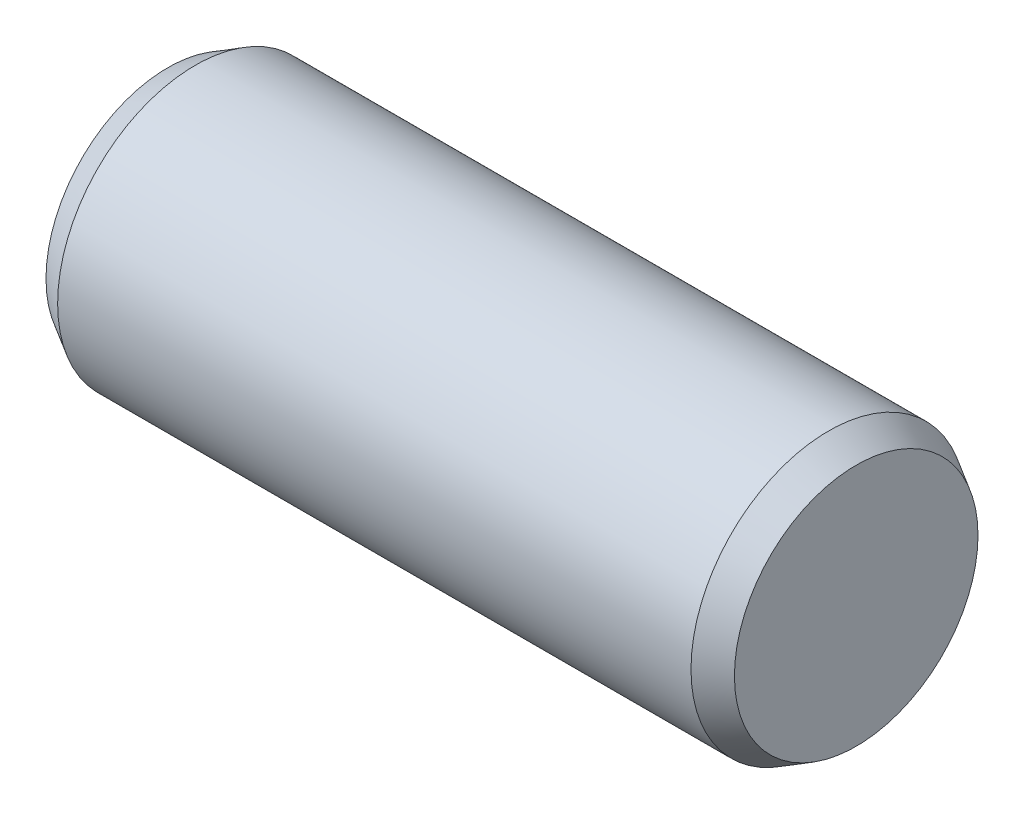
from build123d import *


with BuildPart() as part:
    # BodySke → BaseBody (revolve)
    with BuildSketch(Plane.XY, mode=Mode.PRIVATE) as basebody_sk:
        Polygon((0, 0), (0, 17.690598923), (4, 20), (96, 20), (100, 17.690598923), (100, 0), align=None)
    revolve(basebody_sk.sketch.rotate(Axis((0, 0, 0), (1, 0, 0)), 90), axis=Axis((0, 0, 0), (1, 0, 0)))


solid = part.part
